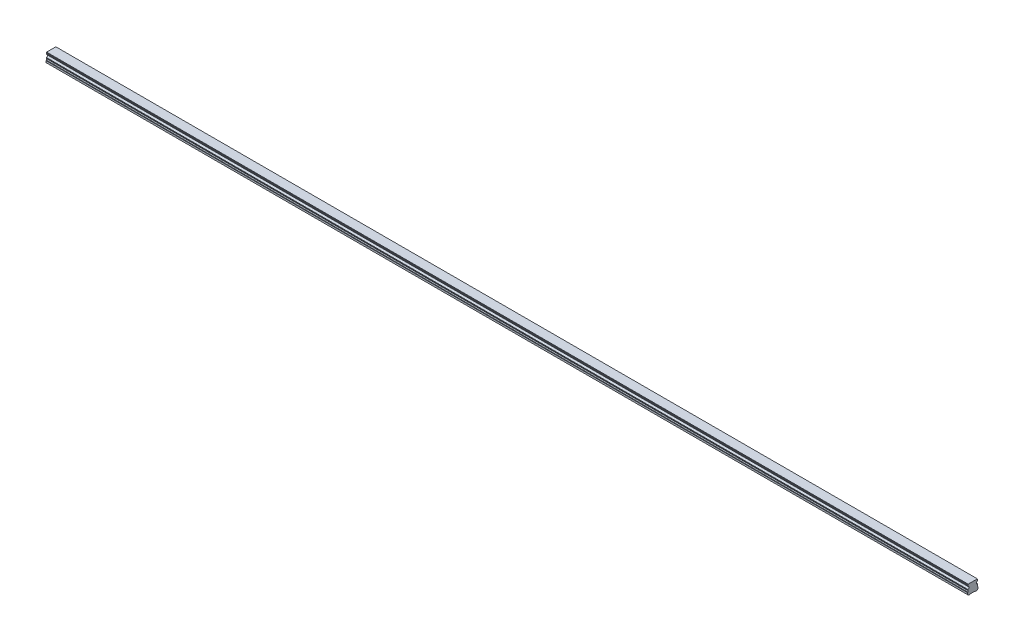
from build123d import *

# Parameters (mm, degrees)
BOSS_EXTRUDE1_DEPTH        = 1320
SKETCH3_R                  = 2.5
SKETCH3_R_2                = 2.1
CUT_EXTRUDE3_DEPTH         = 7
SKETCH3_2_R                = 2.1
CUT_EXTRUDE4_DEPTH         = 9.5
CHAMFER1_SIZE              = 0.4
LPATTERN2_COUNT            = 22
LPATTERN2_PITCH            = 60
CHAMFER1_OF_LPATTERN2_SIZE = 0.4


with BuildPart() as part:
    # Sketch1 → Boss-Extrude1 (new body)
    with BuildSketch(Plane(origin=(0, 0, 0), x_dir=(0, 0, -1), z_dir=(1, 0, 0))):
        with BuildLine():
            Line((6.59, 14), (-6.59, 14))
            Line((-6.59, 14), (-6.59, 13.15))
            Line((-6.59, 13.15), (-6.96, 12.356532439))
            Line((-6.96, 12.356532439), (-6.96, 11.435174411))
            ThreePointArc((-6.96, 11.435174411), (-5.25, 9.5), (-6.96, 7.564825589))
            Line((-6.96, 7.564825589), (-6.96, 6.643467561))
            Line((-6.96, 6.643467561), (-6.59, 5.85))
            Line((-6.59, 5.85), (-7.032116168, 4.2))
            Line((-7.032116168, 4.2), (-7.5, 3.929867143))
            Line((-7.5, 3.929867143), (-7.5, 1.4))
            Line((-7.5, 1.4), (-6.1, 0))
            Line((-6.1, 0), (-3.65, 0))
            Line((-3.65, 0), (-3.25, 0.4))
            Line((-3.25, 0.4), (3.25, 0.4))
            Line((3.25, 0.4), (3.65, 0))
            Line((3.65, 0), (6.1, 0))
            Line((6.1, 0), (7.5, 1.4))
            Line((7.5, 1.4), (7.5, 3.929867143))
            Line((7.5, 3.929867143), (7.032116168, 4.2))
            Line((7.032116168, 4.2), (6.59, 5.85))
            Line((6.59, 5.85), (6.96, 6.643467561))
            Line((6.96, 6.643467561), (6.96, 7.564825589))
            ThreePointArc((6.96, 7.564825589), (5.25, 9.5), (6.96, 11.435174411))
            Line((6.96, 11.435174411), (6.96, 12.356532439))
            Line((6.96, 12.356532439), (6.59, 13.15))
            Line((6.59, 13.15), (6.59, 14))
        make_face()
    extrude(amount=BOSS_EXTRUDE1_DEPTH)

    # Sketch3 → Cut-Extrude3 (cut)
    with BuildSketch(Plane.XZ):
        with Locations(Location((30, 0, 0), (0, 0, 270))):
            Circle(SKETCH3_R)
        with Locations(Location((30, 0, 0), (0, 0, 270))):
            Circle(SKETCH3_R_2, mode=Mode.SUBTRACT)
    cut_extrude3 = extrude(amount=-CUT_EXTRUDE3_DEPTH, mode=Mode.SUBTRACT)

    # Sketch3_2 → Cut-Extrude4 (cut)
    with BuildSketch(Plane.XZ):
        with Locations(Location((30, 0, 0), (0, 0, 270))):
            Circle(SKETCH3_2_R)
    cut_extrude4 = extrude(amount=-CUT_EXTRUDE4_DEPTH, mode=Mode.SUBTRACT)

    # Cut-Extrude5 cone 1 section (on through the dimple's axis) → Cut-Extrude5 (revolve, cut)
    with BuildSketch(Plane(origin=(30, 9.5, 0), x_dir=(0, 0, -1), z_dir=(1, 0, 0))):
        Polygon((0, 0), (2.1, 0), (0, 1.212435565), align=None)
    revolve(axis=Axis((30, 9.5, 0), (0, 1, 0)), mode=Mode.SUBTRACT)

    # Chamfer1
    chamfer1_edges = [part.edges().sort_by_distance(p)[0] for p in [
        (30, 0.4, 2.5),
    ]]
    chamfer(chamfer1_edges, length=CHAMFER1_SIZE)

    # LPattern2: Cut-Extrude3, Cut-Extrude4 ×22
    with Locations(*[(i * LPATTERN2_PITCH, 0, 0) for i in range(1, LPATTERN2_COUNT)]):
        add(cut_extrude3, mode=Mode.SUBTRACT)
        add(cut_extrude4, mode=Mode.SUBTRACT)

    # Chamfer1 of LPattern2
    chamfer1_of_lpattern2_edges = [part.edges().sort_by_distance(p)[0] for p in [
        (90, 0.4, 2.5),
        (150, 0.4, 2.5),
        (210, 0.4, 2.5),
        (270, 0.4, 2.5),
        (330, 0.4, 2.5),
        (390, 0.4, 2.5),
        (450, 0.4, 2.5),
        (510, 0.4, 2.5),
        (570, 0.4, 2.5),
        (630, 0.4, 2.5),
        (690, 0.4, 2.5),
        (750, 0.4, 2.5),
        (810, 0.4, 2.5),
        (870, 0.4, 2.5),
        (930, 0.4, 2.5),
        (990, 0.4, 2.5),
        (1050, 0.4, 2.5),
        (1110, 0.4, 2.5),
        (1170, 0.4, 2.5),
        (1230, 0.4, 2.5),
        (1290, 0.4, 2.5),
    ]]
    chamfer(chamfer1_of_lpattern2_edges, length=CHAMFER1_OF_LPATTERN2_SIZE)


solid = part.part
